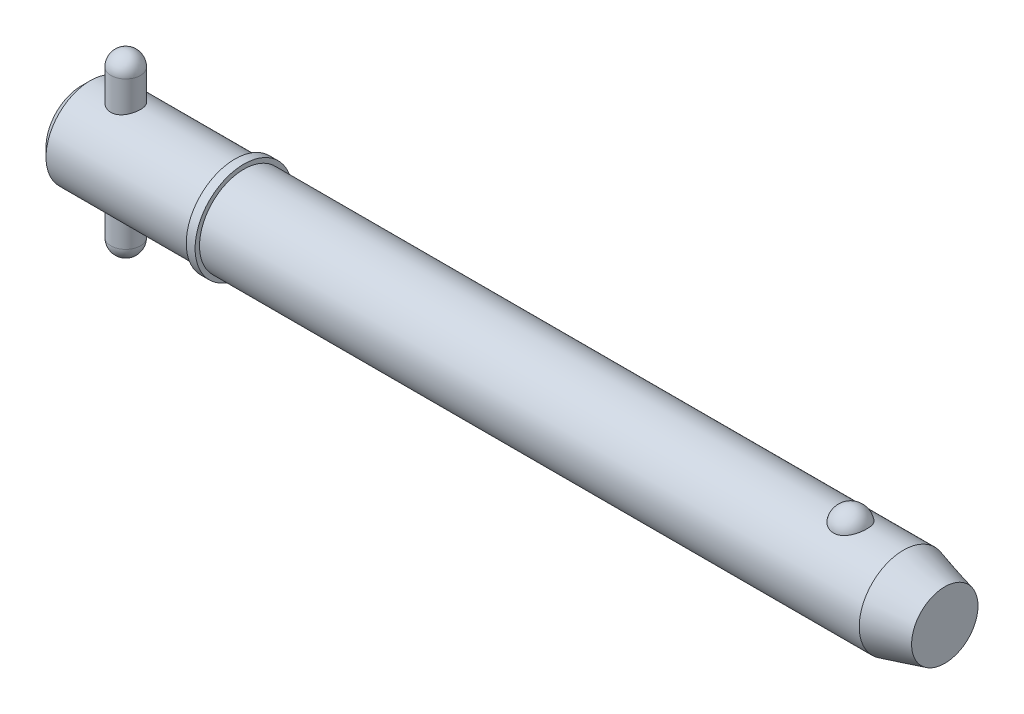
ISO-10303-21;
HEADER;
FILE_DESCRIPTION(('STEP AP214'),'2;1');
FILE_NAME('part.step','',(''),(''),'','','');
FILE_SCHEMA(('AUTOMOTIVE_DESIGN { 1 0 10303 214 1 1 1 1 }'));
ENDSEC;
DATA;
#1=APPLICATION_CONTEXT('core data for automotive mechanical design processes');
#2=APPLICATION_PROTOCOL_DEFINITION('international standard','automotive_design',2000,#1);
#3=PRODUCT_CONTEXT('',#1,'mechanical');
#4=PRODUCT('Part','Part','',(#3));
#5=PRODUCT_RELATED_PRODUCT_CATEGORY('part','',(#4));
#6=PRODUCT_DEFINITION_FORMATION('','',#4);
#7=PRODUCT_DEFINITION_CONTEXT('part definition',#1,'design');
#8=PRODUCT_DEFINITION('design','',#6,#7);
#9=PRODUCT_DEFINITION_SHAPE('','',#8);
#10=(LENGTH_UNIT() NAMED_UNIT(*) SI_UNIT(.MILLI.,.METRE.));
#11=(NAMED_UNIT(*) PLANE_ANGLE_UNIT() SI_UNIT($,.RADIAN.));
#12=(NAMED_UNIT(*) SI_UNIT($,.STERADIAN.) SOLID_ANGLE_UNIT());
#13=UNCERTAINTY_MEASURE_WITH_UNIT(LENGTH_MEASURE(1.E-05),#10,'distance_accuracy_value','');
#14=(GEOMETRIC_REPRESENTATION_CONTEXT(3) GLOBAL_UNCERTAINTY_ASSIGNED_CONTEXT((#13)) GLOBAL_UNIT_ASSIGNED_CONTEXT((#10,
#11,#12)) REPRESENTATION_CONTEXT('',''));
#15=CARTESIAN_POINT('',(0.,0.,0.));
#16=DIRECTION('',(0.,0.,1.));
#17=DIRECTION('',(1.,0.,0.));
#18=AXIS2_PLACEMENT_3D('',#15,#16,#17);
#19=CARTESIAN_POINT('',(9.525,19.05,0.));
#20=DIRECTION('',(0.,-1.,0.));
#21=DIRECTION('',(0.,0.,-1.));
#22=AXIS2_PLACEMENT_3D('',#19,#20,#21);
#23=CYLINDRICAL_SURFACE('',#22,3.175);
#24=CARTESIAN_POINT('',(9.525,-15.875,0.));
#25=DIRECTION('',(0.,-1.,0.));
#26=DIRECTION('',(0.,0.,-1.));
#27=AXIS2_PLACEMENT_3D('',#24,#25,#26);
#28=CIRCLE('',#27,3.175);
#29=CARTESIAN_POINT('',(9.525,-15.875,-3.175));
#30=VERTEX_POINT('',#29);
#31=EDGE_CURVE('P0_E10',#30,#30,#28,.F.);
#32=CARTESIAN_POINT('',(9.525,15.875,0.));
#33=DIRECTION('',(0.,-1.,0.));
#34=DIRECTION('',(0.,0.,-1.));
#35=AXIS2_PLACEMENT_3D('',#32,#33,#34);
#36=CIRCLE('',#35,3.175);
#37=CARTESIAN_POINT('',(9.525,15.875,-3.175));
#38=VERTEX_POINT('',#37);
#39=EDGE_CURVE('P0_E21',#38,#38,#36,.T.);
#40=CARTESIAN_POINT('',(9.525,-15.875,-3.175));
#41=CARTESIAN_POINT('',(9.525,-15.5442708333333,-3.175));
#42=CARTESIAN_POINT('',(9.525,-15.2135416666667,-3.175));
#43=CARTESIAN_POINT('',(9.525,-14.5520833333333,-3.175));
#44=CARTESIAN_POINT('',(9.525,-14.2213541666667,-3.175));
#45=CARTESIAN_POINT('',(9.525,-13.5598958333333,-3.175));
#46=CARTESIAN_POINT('',(9.525,-13.2291666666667,-3.175));
#47=CARTESIAN_POINT('',(9.525,-12.5677083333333,-3.175));
#48=CARTESIAN_POINT('',(9.525,-12.2369791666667,-3.175));
#49=CARTESIAN_POINT('',(9.525,-11.5755208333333,-3.175));
#50=CARTESIAN_POINT('',(9.525,-11.2447916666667,-3.175));
#51=CARTESIAN_POINT('',(9.525,-10.5833333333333,-3.175));
#52=CARTESIAN_POINT('',(9.525,-10.2526041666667,-3.175));
#53=CARTESIAN_POINT('',(9.525,-9.59114583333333,-3.175));
#54=CARTESIAN_POINT('',(9.525,-9.26041666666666,-3.175));
#55=CARTESIAN_POINT('',(9.525,-8.59895833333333,-3.175));
#56=CARTESIAN_POINT('',(9.525,-8.26822916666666,-3.175));
#57=CARTESIAN_POINT('',(9.525,-7.60677083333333,-3.175));
#58=CARTESIAN_POINT('',(9.525,-7.27604166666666,-3.175));
#59=CARTESIAN_POINT('',(9.525,-6.61458333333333,-3.175));
#60=CARTESIAN_POINT('',(9.525,-6.28385416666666,-3.175));
#61=CARTESIAN_POINT('',(9.525,-5.62239583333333,-3.175));
#62=CARTESIAN_POINT('',(9.525,-5.29166666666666,-3.175));
#63=CARTESIAN_POINT('',(9.525,-4.63020833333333,-3.175));
#64=CARTESIAN_POINT('',(9.525,-4.29947916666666,-3.175));
#65=CARTESIAN_POINT('',(9.525,-3.63802083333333,-3.175));
#66=CARTESIAN_POINT('',(9.525,-3.30729166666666,-3.175));
#67=CARTESIAN_POINT('',(9.525,-2.64583333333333,-3.175));
#68=CARTESIAN_POINT('',(9.525,-2.31510416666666,-3.175));
#69=CARTESIAN_POINT('',(9.525,-1.65364583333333,-3.175));
#70=CARTESIAN_POINT('',(9.525,-1.32291666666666,-3.175));
#71=CARTESIAN_POINT('',(9.525,-0.661458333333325,-3.175));
#72=CARTESIAN_POINT('',(9.525,-0.330729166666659,-3.175));
#73=CARTESIAN_POINT('',(9.525,0.330729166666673,-3.175));
#74=CARTESIAN_POINT('',(9.525,0.661458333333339,-3.175));
#75=CARTESIAN_POINT('',(9.525,1.32291666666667,-3.175));
#76=CARTESIAN_POINT('',(9.525,1.65364583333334,-3.175));
#77=CARTESIAN_POINT('',(9.525,2.31510416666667,-3.175));
#78=CARTESIAN_POINT('',(9.525,2.64583333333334,-3.175));
#79=CARTESIAN_POINT('',(9.525,3.30729166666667,-3.175));
#80=CARTESIAN_POINT('',(9.525,3.63802083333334,-3.175));
#81=CARTESIAN_POINT('',(9.525,4.29947916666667,-3.175));
#82=CARTESIAN_POINT('',(9.525,4.63020833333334,-3.175));
#83=CARTESIAN_POINT('',(9.525,5.29166666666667,-3.175));
#84=CARTESIAN_POINT('',(9.525,5.62239583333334,-3.175));
#85=CARTESIAN_POINT('',(9.525,6.28385416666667,-3.175));
#86=CARTESIAN_POINT('',(9.525,6.61458333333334,-3.175));
#87=CARTESIAN_POINT('',(9.525,7.27604166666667,-3.175));
#88=CARTESIAN_POINT('',(9.525,7.60677083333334,-3.175));
#89=CARTESIAN_POINT('',(9.525,8.26822916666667,-3.175));
#90=CARTESIAN_POINT('',(9.525,8.59895833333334,-3.175));
#91=CARTESIAN_POINT('',(9.525,9.26041666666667,-3.175));
#92=CARTESIAN_POINT('',(9.525,9.59114583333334,-3.175));
#93=CARTESIAN_POINT('',(9.525,10.2526041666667,-3.175));
#94=CARTESIAN_POINT('',(9.525,10.5833333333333,-3.175));
#95=CARTESIAN_POINT('',(9.525,11.2447916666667,-3.175));
#96=CARTESIAN_POINT('',(9.525,11.5755208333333,-3.175));
#97=CARTESIAN_POINT('',(9.525,12.2369791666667,-3.175));
#98=CARTESIAN_POINT('',(9.525,12.5677083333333,-3.175));
#99=CARTESIAN_POINT('',(9.525,13.2291666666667,-3.175));
#100=CARTESIAN_POINT('',(9.525,13.5598958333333,-3.175));
#101=CARTESIAN_POINT('',(9.525,14.2213541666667,-3.175));
#102=CARTESIAN_POINT('',(9.525,14.5520833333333,-3.175));
#103=CARTESIAN_POINT('',(9.525,15.2135416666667,-3.175));
#104=CARTESIAN_POINT('',(9.525,15.5442708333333,-3.175));
#105=CARTESIAN_POINT('',(9.525,15.875,-3.175));
#106=B_SPLINE_CURVE_WITH_KNOTS('',3,(#40,#41,#42,#43,#44,#45,#46,#47,#48,#49,#50,#51,#52,#53,
#54,#55,#56,#57,#58,#59,#60,#61,#62,#63,#64,#65,#66,#67,#68,#69,#70,#71,#72,#73,#74,#75,#76,#77,
#78,#79,#80,#81,#82,#83,#84,#85,#86,#87,#88,#89,#90,#91,#92,#93,#94,#95,#96,#97,#98,#99,#100,
#101,#102,#103,#104,#105),.UNSPECIFIED.,.F.,.F.,(4,2,2,2,2,2,2,2,2,2,2,2,2,2,2,2,2,2,2,2,2,2,2,
2,2,2,2,2,2,2,2,2,4),(0.,0.992187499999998,1.984375,2.9765625,3.96875,4.96093749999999,5.953125,
6.9453125,7.9375,8.92968749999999,9.921875,10.9140625,11.90625,12.8984375,13.890625,14.8828125,
15.875,16.8671875,17.859375,18.8515625,19.84375,20.8359375,21.828125,22.8203125,23.8125,
24.8046875,25.796875,26.7890625,27.78125,28.7734375,29.765625,30.7578125,31.75),.UNSPECIFIED.);
#107=EDGE_CURVE('P0_BSEAM14',#30,#38,#106,.T.);
#108=ORIENTED_EDGE('',*,*,#31,.T.);
#109=ORIENTED_EDGE('',*,*,#39,.T.);
#110=ORIENTED_EDGE('',*,*,#107,.T.);
#111=ORIENTED_EDGE('',*,*,#107,.F.);
#112=EDGE_LOOP('',(#108,#110,#109,#111));
#113=FACE_BOUND('',#112,.T.);
#114=ADVANCED_FACE('P0_F14',(#113),#23,.T.);
#115=CARTESIAN_POINT('',(9.525,-15.875,0.));
#116=DIRECTION('',(0.,0.,1.));
#117=DIRECTION('',(1.,0.,0.));
#118=AXIS2_PLACEMENT_3D('',#115,#116,#117);
#119=SPHERICAL_SURFACE('',#118,3.175);
#120=CARTESIAN_POINT('',(9.525,-15.875,0.));
#121=DIRECTION('',(0.,-1.,0.));
#122=DIRECTION('',(0.,0.,-1.));
#123=AXIS2_PLACEMENT_3D('',#120,#121,#122);
#124=SPHERICAL_SURFACE('',#123,3.175);
#125=ORIENTED_EDGE('',*,*,#31,.F.);
#126=EDGE_LOOP('',(#125));
#127=FACE_BOUND('',#126,.T.);
#128=ADVANCED_FACE('P0_F29',(#127),#124,.T.);
#129=CARTESIAN_POINT('',(9.525,15.875,0.));
#130=DIRECTION('',(0.,0.,1.));
#131=DIRECTION('',(1.,0.,0.));
#132=AXIS2_PLACEMENT_3D('',#129,#130,#131);
#133=SPHERICAL_SURFACE('',#132,3.175);
#134=CARTESIAN_POINT('',(9.525,15.875,0.));
#135=DIRECTION('',(0.,-1.,0.));
#136=DIRECTION('',(0.,0.,-1.));
#137=AXIS2_PLACEMENT_3D('',#134,#135,#136);
#138=SPHERICAL_SURFACE('',#137,3.175);
#139=ORIENTED_EDGE('',*,*,#39,.F.);
#140=EDGE_LOOP('',(#139));
#141=FACE_BOUND('',#140,.T.);
#142=ADVANCED_FACE('P0_F16',(#141),#138,.T.);
#143=CLOSED_SHELL('',(#114,#128,#142));
#144=MANIFOLD_SOLID_BREP('P0_B1',#143);
#145=CARTESIAN_POINT('',(0.,0.,0.));
#146=DIRECTION('',(1.,0.,0.));
#147=DIRECTION('',(0.,0.,-1.));
#148=AXIS2_PLACEMENT_3D('',#145,#146,#147);
#149=CYLINDRICAL_SURFACE('',#148,9.525);
#150=CARTESIAN_POINT('',(176.843054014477,0.,0.));
#151=DIRECTION('',(1.,0.,0.));
#152=DIRECTION('',(0.,0.,-1.));
#153=AXIS2_PLACEMENT_3D('',#150,#151,#152);
#154=CIRCLE('',#153,9.525);
#155=CARTESIAN_POINT('',(176.843054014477,0.,-9.525));
#156=VERTEX_POINT('',#155);
#157=EDGE_CURVE('P1_E81',#156,#156,#154,.T.);
#158=ORIENTED_EDGE('',*,*,#157,.F.);
#159=EDGE_LOOP('',(#158));
#160=FACE_BOUND('',#159,.T.);
#161=CARTESIAN_POINT('',(34.93,0.,0.));
#162=DIRECTION('',(1.,0.,0.));
#163=DIRECTION('',(0.,0.,-1.));
#164=AXIS2_PLACEMENT_3D('',#161,#162,#163);
#165=CIRCLE('',#164,9.525);
#166=CARTESIAN_POINT('',(34.93,0.,-9.525));
#167=VERTEX_POINT('',#166);
#168=EDGE_CURVE('P1_E85',#167,#167,#165,.T.);
#169=ORIENTED_EDGE('',*,*,#168,.T.);
#170=EDGE_LOOP('',(#169));
#171=FACE_BOUND('',#170,.T.);
#172=CARTESIAN_POINT('',(165.445757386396,8.80405803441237,3.63513233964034));
#173=CARTESIAN_POINT('',(165.351676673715,8.80405953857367,3.63513053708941));
#174=CARTESIAN_POINT('',(165.257561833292,8.80561325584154,3.63137461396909));
#175=CARTESIAN_POINT('',(165.070012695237,8.81177748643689,3.61638665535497));
#176=CARTESIAN_POINT('',(164.976578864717,8.81638992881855,3.60514990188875));
#177=CARTESIAN_POINT('',(164.697945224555,8.8346711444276,3.56024627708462));
#178=CARTESIAN_POINT('',(164.514691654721,8.85278327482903,3.51538626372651));
#179=CARTESIAN_POINT('',(164.159509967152,8.89871214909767,3.39742145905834));
#180=CARTESIAN_POINT('',(163.987553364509,8.92650327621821,3.32439116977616));
#181=CARTESIAN_POINT('',(163.658707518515,8.9887481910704,3.15220244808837));
#182=CARTESIAN_POINT('',(163.501811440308,9.02319893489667,3.05305594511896));
#183=CARTESIAN_POINT('',(163.202214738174,9.09629186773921,2.82797815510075));
#184=CARTESIAN_POINT('',(163.060060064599,9.13502685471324,2.70135138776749));
#185=CARTESIAN_POINT('',(162.798299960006,9.2118657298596,2.42641932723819));
#186=CARTESIAN_POINT('',(162.678701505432,9.24996941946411,2.27810735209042));
#187=CARTESIAN_POINT('',(162.459645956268,9.32341082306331,1.95652290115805));
#188=CARTESIAN_POINT('',(162.361317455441,9.35855090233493,1.78243511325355));
#189=CARTESIAN_POINT('',(162.193819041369,9.42045142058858,1.419372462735));
#190=CARTESIAN_POINT('',(162.124651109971,9.44721128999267,1.23039658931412));
#191=CARTESIAN_POINT('',(162.016199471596,9.48990641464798,0.840370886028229));
#192=CARTESIAN_POINT('',(161.977288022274,9.50570658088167,0.639202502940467));
#193=CARTESIAN_POINT('',(161.931555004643,9.52433146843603,0.232664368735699));
#194=CARTESIAN_POINT('',(161.924732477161,9.52715657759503,0.0272947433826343));
#195=CARTESIAN_POINT('',(161.943255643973,9.51956918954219,-0.380478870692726));
#196=CARTESIAN_POINT('',(161.968405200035,9.50923740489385,-0.582893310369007));
#197=CARTESIAN_POINT('',(162.05002537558,9.47651897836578,-0.980293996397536));
#198=CARTESIAN_POINT('',(162.106496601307,9.45413210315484,-1.17528009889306));
#199=CARTESIAN_POINT('',(162.249719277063,9.39954044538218,-1.55263697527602));
#200=CARTESIAN_POINT('',(162.336512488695,9.36732213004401,-1.73498993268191));
#201=CARTESIAN_POINT('',(162.538610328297,9.29640700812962,-2.08177763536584));
#202=CARTESIAN_POINT('',(162.653917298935,9.25770966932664,-2.24621090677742));
#203=CARTESIAN_POINT('',(162.911264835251,9.17775604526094,-2.5533833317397));
#204=CARTESIAN_POINT('',(163.053434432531,9.136488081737,-2.696011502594));
#205=CARTESIAN_POINT('',(163.36089985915,9.05620497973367,-2.95451229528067));
#206=CARTESIAN_POINT('',(163.526193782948,9.01718965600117,-3.07038711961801));
#207=CARTESIAN_POINT('',(163.872052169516,8.94680019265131,-3.26976836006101));
#208=CARTESIAN_POINT('',(164.052227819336,8.91528408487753,-3.35389750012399));
#209=CARTESIAN_POINT('',(164.425651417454,8.86272514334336,-3.49043503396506));
#210=CARTESIAN_POINT('',(164.618894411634,8.84167836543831,-3.54285537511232));
#211=CARTESIAN_POINT('',(165.002503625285,8.81348056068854,-3.61241306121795));
#212=CARTESIAN_POINT('',(165.192525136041,8.80568348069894,-3.6311933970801));
#213=CARTESIAN_POINT('',(165.573190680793,8.80289410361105,-3.63795342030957));
#214=CARTESIAN_POINT('',(165.763834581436,8.80789922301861,-3.62593932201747));
#215=CARTESIAN_POINT('',(166.134007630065,8.82974915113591,-3.57238430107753));
#216=CARTESIAN_POINT('',(166.313697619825,8.84621463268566,-3.53178890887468));
#217=CARTESIAN_POINT('',(166.663422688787,8.88875330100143,-3.42331083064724));
#218=CARTESIAN_POINT('',(166.833456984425,8.91482726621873,-3.35542593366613));
#219=CARTESIAN_POINT('',(167.163237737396,8.97448239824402,-3.19248225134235));
#220=CARTESIAN_POINT('',(167.322680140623,9.00821446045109,-3.0968647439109));
#221=CARTESIAN_POINT('',(167.623513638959,9.07935398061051,-2.88162736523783));
#222=CARTESIAN_POINT('',(167.764900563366,9.11676228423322,-2.76200196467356));
#223=CARTESIAN_POINT('',(168.03331931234,9.19347419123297,-2.49516285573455));
#224=CARTESIAN_POINT('',(168.159275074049,9.23277872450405,-2.34686614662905));
#225=CARTESIAN_POINT('',(168.385522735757,9.30737610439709,-2.03093683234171));
#226=CARTESIAN_POINT('',(168.48581004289,9.34266823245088,-1.86330077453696));
#227=CARTESIAN_POINT('',(168.661514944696,9.40674710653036,-1.50744893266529));
#228=CARTESIAN_POINT('',(168.736041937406,9.4352917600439,-1.31874876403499));
#229=CARTESIAN_POINT('',(168.85416505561,9.48144132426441,-0.930631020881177));
#230=CARTESIAN_POINT('',(168.897760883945,9.49904612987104,-0.731213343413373));
#231=CARTESIAN_POINT('',(168.953158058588,9.5215314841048,-0.327147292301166));
#232=CARTESIAN_POINT('',(168.964935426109,9.52640243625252,-0.122495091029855));
#233=CARTESIAN_POINT('',(168.956382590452,9.52289571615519,0.286018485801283));
#234=CARTESIAN_POINT('',(168.93605305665,9.51451832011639,0.489879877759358));
#235=CARTESIAN_POINT('',(168.863884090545,9.48544083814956,0.889994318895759));
#236=CARTESIAN_POINT('',(168.812199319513,9.46480124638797,1.08627971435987));
#237=CARTESIAN_POINT('',(168.678491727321,9.41333895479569,1.46682086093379));
#238=CARTESIAN_POINT('',(168.596466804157,9.38251554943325,1.65107577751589));
#239=CARTESIAN_POINT('',(168.40319292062,9.31365636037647,2.00346348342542));
#240=CARTESIAN_POINT('',(168.291783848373,9.27558138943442,2.17150083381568));
#241=CARTESIAN_POINT('',(168.042294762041,9.19638714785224,2.48563115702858));
#242=CARTESIAN_POINT('',(167.904216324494,9.15526805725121,2.63172542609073));
#243=CARTESIAN_POINT('',(167.604843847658,9.07465393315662,2.89750997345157));
#244=CARTESIAN_POINT('',(167.443610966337,9.03515496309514,3.01726776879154));
#245=CARTESIAN_POINT('',(167.101613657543,8.96227564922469,3.22732920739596));
#246=CARTESIAN_POINT('',(166.920841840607,8.92889763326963,3.31762165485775));
#247=CARTESIAN_POINT('',(166.551445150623,8.8734538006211,3.46314419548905));
#248=CARTESIAN_POINT('',(166.36332371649,8.85102983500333,3.51950082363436));
#249=CARTESIAN_POINT('',(166.07578699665,8.8266696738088,3.57993683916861));
#250=CARTESIAN_POINT('',(165.979133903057,8.82009725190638,3.5960621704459));
#251=CARTESIAN_POINT('',(165.784677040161,8.81020897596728,3.62022512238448));
#252=CARTESIAN_POINT('',(165.68687410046,8.80689090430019,3.62826825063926));
#253=CARTESIAN_POINT('',(165.541224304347,8.80445615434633,3.63416760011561));
#254=CARTESIAN_POINT('',(165.493495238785,8.80405727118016,3.63513325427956));
#255=CARTESIAN_POINT('',(165.445757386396,8.80405803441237,3.63513233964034));
#256=B_SPLINE_CURVE_WITH_KNOTS('',3,(#172,#173,#174,#175,#176,#177,#178,#179,#180,#181,#182,
#183,#184,#185,#186,#187,#188,#189,#190,#191,#192,#193,#194,#195,#196,#197,#198,#199,#200,#201,
#202,#203,#204,#205,#206,#207,#208,#209,#210,#211,#212,#213,#214,#215,#216,#217,#218,#219,#220,
#221,#222,#223,#224,#225,#226,#227,#228,#229,#230,#231,#232,#233,#234,#235,#236,#237,#238,#239,
#240,#241,#242,#243,#244,#245,#246,#247,#248,#249,#250,#251,#252,#253,#254,#255),.UNSPECIFIED.,
.T.,.F.,(4,2,2,2,2,2,2,2,2,2,2,2,2,2,2,2,2,2,2,2,2,2,2,2,2,2,2,2,2,2,2,2,2,2,2,2,2,2,2,2,2,4),
(0.,0.282202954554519,0.564584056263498,1.13017050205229,1.69427128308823,2.25811483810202,
2.83836627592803,3.41879688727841,4.02497117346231,4.63118665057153,5.2447475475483,
5.85829010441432,6.46808687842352,7.07789545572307,7.68854723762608,8.29924920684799,
8.9129628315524,9.52662591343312,10.1275338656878,10.7282152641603,11.2986646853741,
11.8689989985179,12.4213015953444,12.973648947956,13.5380053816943,14.1024919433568,
14.695298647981,15.2882113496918,15.8999469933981,16.5116885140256,17.1238909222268,
17.7360805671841,18.3452748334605,18.9545113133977,19.567138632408,20.179729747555,
20.7907316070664,21.4019653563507,21.9915938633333,22.2859053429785,22.5800161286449,
22.7232098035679),.UNSPECIFIED.);
#257=CARTESIAN_POINT('',(165.445757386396,8.80405803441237,3.63513233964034));
#258=VERTEX_POINT('',#257);
#259=EDGE_CURVE('P1_E35',#258,#258,#256,.T.);
#260=ORIENTED_EDGE('',*,*,#259,.T.);
#261=EDGE_LOOP('',(#260));
#262=FACE_BOUND('',#261,.T.);
#263=ADVANCED_FACE('P1_F13',(#160,#171,#262),#149,.T.);
#264=CARTESIAN_POINT('',(0.,0.,0.));
#265=DIRECTION('',(-1.,0.,0.));
#266=DIRECTION('',(0.,0.,1.));
#267=AXIS2_PLACEMENT_3D('',#264,#265,#266);
#268=PLANE('',#267);
#269=CARTESIAN_POINT('',(0.,0.,0.));
#270=DIRECTION('',(1.,0.,0.));
#271=DIRECTION('',(0.,0.,-1.));
#272=AXIS2_PLACEMENT_3D('',#269,#270,#271);
#273=CIRCLE('',#272,7.62);
#274=CARTESIAN_POINT('',(0.,0.,-7.62));
#275=VERTEX_POINT('',#274);
#276=EDGE_CURVE('P1_E9',#275,#275,#273,.T.);
#277=ORIENTED_EDGE('',*,*,#276,.F.);
#278=EDGE_LOOP('',(#277));
#279=FACE_BOUND('',#278,.T.);
#280=ADVANCED_FACE('P1_F15',(#279),#268,.T.);
#281=CARTESIAN_POINT('',(1.90499999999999,0.,0.));
#282=DIRECTION('',(1.,0.,0.));
#283=DIRECTION('',(0.,0.,-1.));
#284=AXIS2_PLACEMENT_3D('',#281,#282,#283);
#285=CONICAL_SURFACE('',#284,9.525,0.785398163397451);
#286=ORIENTED_EDGE('',*,*,#276,.T.);
#287=EDGE_LOOP('',(#286));
#288=FACE_BOUND('',#287,.T.);
#289=CARTESIAN_POINT('',(1.90499999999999,0.,0.));
#290=DIRECTION('',(1.,0.,0.));
#291=DIRECTION('',(0.,0.,-1.));
#292=AXIS2_PLACEMENT_3D('',#289,#290,#291);
#293=CIRCLE('',#292,9.525);
#294=CARTESIAN_POINT('',(1.90499999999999,0.,-9.525));
#295=VERTEX_POINT('',#294);
#296=EDGE_CURVE('P1_E26',#295,#295,#293,.T.);
#297=ORIENTED_EDGE('',*,*,#296,.F.);
#298=EDGE_LOOP('',(#297));
#299=FACE_BOUND('',#298,.T.);
#300=ADVANCED_FACE('P1_F77',(#288,#299),#285,.T.);
#301=CARTESIAN_POINT('',(0.,0.,0.));
#302=DIRECTION('',(1.,0.,0.));
#303=DIRECTION('',(0.,0.,-1.));
#304=AXIS2_PLACEMENT_3D('',#301,#302,#303);
#305=CYLINDRICAL_SURFACE('',#304,9.525);
#306=CARTESIAN_POINT('',(9.525,-8.98025612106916,3.175));
#307=CARTESIAN_POINT('',(9.35206354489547,-8.98025555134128,3.17500081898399));
#308=CARTESIAN_POINT('',(9.17913201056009,-8.98530617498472,3.16082293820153));
#309=CARTESIAN_POINT('',(8.83839221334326,-9.00485797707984,3.10467734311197));
#310=CARTESIAN_POINT('',(8.67058479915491,-9.0193607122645,3.06270505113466));
#311=CARTESIAN_POINT('',(8.34508461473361,-9.05599546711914,2.95260866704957));
#312=CARTESIAN_POINT('',(8.18737272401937,-9.07811252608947,2.88453582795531));
#313=CARTESIAN_POINT('',(7.88555684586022,-9.12746212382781,2.72434567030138));
#314=CARTESIAN_POINT('',(7.74145587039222,-9.1546957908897,2.63222304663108));
#315=CARTESIAN_POINT('',(7.46531411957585,-9.21240503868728,2.42268738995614));
#316=CARTESIAN_POINT('',(7.33388351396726,-9.24296141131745,2.30449228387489));
#317=CARTESIAN_POINT('',(7.09229340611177,-9.30319020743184,2.0478358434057));
#318=CARTESIAN_POINT('',(6.98213731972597,-9.33286248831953,1.90937126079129));
#319=CARTESIAN_POINT('',(6.78345450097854,-9.38891527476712,1.61164431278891));
#320=CARTESIAN_POINT('',(6.69556709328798,-9.41518969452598,1.45193356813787));
#321=CARTESIAN_POINT('',(6.54814671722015,-9.46053437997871,1.11896913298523));
#322=CARTESIAN_POINT('',(6.48860610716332,-9.47960658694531,0.945719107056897));
#323=CARTESIAN_POINT('',(6.40163866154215,-9.50782564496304,0.596991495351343));
#324=CARTESIAN_POINT('',(6.373166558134,-9.5172947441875,0.421801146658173));
#325=CARTESIAN_POINT('',(6.3458207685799,-9.52638456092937,0.068890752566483));
#326=CARTESIAN_POINT('',(6.34693945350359,-9.52600781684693,-0.108828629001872));
#327=CARTESIAN_POINT('',(6.37808050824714,-9.51566675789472,-0.454353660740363));
#328=CARTESIAN_POINT('',(6.4069675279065,-9.50607905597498,-0.622274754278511));
#329=CARTESIAN_POINT('',(6.490947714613,-9.47886621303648,-0.950732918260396));
#330=CARTESIAN_POINT('',(6.54604265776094,-9.46124052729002,-1.11126948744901));
#331=CARTESIAN_POINT('',(6.68153768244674,-9.41945253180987,-1.42288410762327));
#332=CARTESIAN_POINT('',(6.76226085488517,-9.3952073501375,-1.57381010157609));
#333=CARTESIAN_POINT('',(6.94645456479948,-9.34270397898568,-1.86030973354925));
#334=CARTESIAN_POINT('',(7.04993142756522,-9.31444467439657,-1.99587908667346));
#335=CARTESIAN_POINT('',(7.28241619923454,-9.25532159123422,-2.2545702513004));
#336=CARTESIAN_POINT('',(7.4123967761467,-9.22439783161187,-2.37680549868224));
#337=CARTESIAN_POINT('',(7.69127470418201,-9.1645528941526,-2.5980302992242));
#338=CARTESIAN_POINT('',(7.84017496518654,-9.13563202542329,-2.6970162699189));
#339=CARTESIAN_POINT('',(8.15547526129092,-9.08273917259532,-2.87016016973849));
#340=CARTESIAN_POINT('',(8.32209451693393,-9.05884361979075,-2.94394402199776));
#341=CARTESIAN_POINT('',(8.66638917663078,-9.01959241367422,-3.06210713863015));
#342=CARTESIAN_POINT('',(8.84405991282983,-9.00423318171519,-3.10649872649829));
#343=CARTESIAN_POINT('',(9.19682677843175,-8.98460345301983,-3.16281207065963));
#344=CARTESIAN_POINT('',(9.37167742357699,-8.9798639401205,-3.17610837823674));
#345=CARTESIAN_POINT('',(9.72113927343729,-8.9806993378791,-3.17374726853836));
#346=CARTESIAN_POINT('',(9.89575051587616,-8.98627237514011,-3.15809511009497));
#347=CARTESIAN_POINT('',(10.2335233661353,-9.00663737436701,-3.09951644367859));
#348=CARTESIAN_POINT('',(10.3968722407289,-9.02110608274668,-3.05754530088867));
#349=CARTESIAN_POINT('',(10.7141759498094,-9.05727657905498,-2.94866651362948));
#350=CARTESIAN_POINT('',(10.8681291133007,-9.07897964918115,-2.88175444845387));
#351=CARTESIAN_POINT('',(11.1676828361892,-9.12802586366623,-2.72248103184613));
#352=CARTESIAN_POINT('',(11.3128635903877,-9.1555260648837,-2.62937980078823));
#353=CARTESIAN_POINT('',(11.5860387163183,-9.21276315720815,-2.42120937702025));
#354=CARTESIAN_POINT('',(11.7140280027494,-9.24250070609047,-2.30613370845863));
#355=CARTESIAN_POINT('',(11.9555513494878,-9.30259247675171,-2.05070616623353));
#356=CARTESIAN_POINT('',(12.0680936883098,-9.33290753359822,-1.90940458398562));
#357=CARTESIAN_POINT('',(12.267933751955,-9.3893275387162,-1.60917665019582));
#358=CARTESIAN_POINT('',(12.3552323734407,-9.41543263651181,-1.45025092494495));
#359=CARTESIAN_POINT('',(12.5013088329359,-9.46036988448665,-1.12007606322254));
#360=CARTESIAN_POINT('',(12.5602723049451,-9.47924920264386,-0.9489158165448));
#361=CARTESIAN_POINT('',(12.6483355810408,-9.50781089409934,-0.598355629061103));
#362=CARTESIAN_POINT('',(12.6774461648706,-9.5174965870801,-0.4189586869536));
#363=CARTESIAN_POINT('',(12.7040070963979,-9.52632915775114,-0.066088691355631));
#364=CARTESIAN_POINT('',(12.7028811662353,-9.52594996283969,0.107266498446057));
#365=CARTESIAN_POINT('',(12.6725130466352,-9.51586223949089,0.451202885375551));
#366=CARTESIAN_POINT('',(12.643273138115,-9.50615446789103,0.621784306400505));
#367=CARTESIAN_POINT('',(12.5584514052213,-9.47867404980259,0.952633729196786));
#368=CARTESIAN_POINT('',(12.5032953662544,-9.46103195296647,1.1130225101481));
#369=CARTESIAN_POINT('',(12.3686013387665,-9.41949985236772,1.42233126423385));
#370=CARTESIAN_POINT('',(12.2890589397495,-9.39560871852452,1.57124915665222));
#371=CARTESIAN_POINT('',(12.1044667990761,-9.34294133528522,1.85938800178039));
#372=CARTESIAN_POINT('',(11.9985831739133,-9.31401720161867,1.9980473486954));
#373=CARTESIAN_POINT('',(11.7657327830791,-9.25490239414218,2.25609475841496));
#374=CARTESIAN_POINT('',(11.6387592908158,-9.22471131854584,2.37547664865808));
#375=CARTESIAN_POINT('',(11.3613902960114,-9.16505913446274,2.59633024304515));
#376=CARTESIAN_POINT('',(11.2102725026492,-9.13567286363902,2.69691791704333));
#377=CARTESIAN_POINT('',(10.8923631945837,-9.08241113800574,2.87119803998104));
#378=CARTESIAN_POINT('',(10.7255757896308,-9.05853424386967,2.94489751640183));
#379=CARTESIAN_POINT('',(10.3887212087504,-9.02021736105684,3.06020415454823));
#380=CARTESIAN_POINT('',(10.219143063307,-9.00539959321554,3.10311136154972));
#381=CARTESIAN_POINT('',(9.87470703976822,-8.98542092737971,3.16050396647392));
#382=CARTESIAN_POINT('',(9.699851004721,-8.98025669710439,3.17499917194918));
#383=CARTESIAN_POINT('',(9.525,-8.98025612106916,3.175));
#384=B_SPLINE_CURVE_WITH_KNOTS('',3,(#306,#307,#308,#309,#310,#311,#312,#313,#314,#315,#316,
#317,#318,#319,#320,#321,#322,#323,#324,#325,#326,#327,#328,#329,#330,#331,#332,#333,#334,#335,
#336,#337,#338,#339,#340,#341,#342,#343,#344,#345,#346,#347,#348,#349,#350,#351,#352,#353,#354,
#355,#356,#357,#358,#359,#360,#361,#362,#363,#364,#365,#366,#367,#368,#369,#370,#371,#372,#373,
#374,#375,#376,#377,#378,#379,#380,#381,#382,#383),.UNSPECIFIED.,.T.,.F.,(4,2,2,2,2,2,2,2,2,2,2,
2,2,2,2,2,2,2,2,2,2,2,2,2,2,2,2,2,2,2,2,2,2,2,2,2,2,2,4),(0.,0.518161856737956,1.03640907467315,
1.55364379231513,2.07099270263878,2.60671746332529,3.14252816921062,3.69231882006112,
4.24196117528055,4.77247962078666,5.30286129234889,5.81244090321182,6.32205505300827,
6.83836754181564,7.3548237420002,7.89559553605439,8.43645060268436,8.98501631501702,
9.53335188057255,10.056948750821,10.5804505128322,11.0859695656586,11.5915782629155,
12.1132237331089,12.6350231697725,13.1819271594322,13.7288117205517,14.2720628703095,
14.815117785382,15.3326491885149,15.8501386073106,16.3594083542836,16.868770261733,
17.3969527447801,17.925304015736,18.4743376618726,19.023227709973,19.5473069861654,
20.0712053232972),.UNSPECIFIED.);
#385=CARTESIAN_POINT('',(9.525,-8.98025612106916,3.175));
#386=VERTEX_POINT('',#385);
#387=EDGE_CURVE('P1_E17',#386,#386,#384,.T.);
#388=ORIENTED_EDGE('',*,*,#387,.F.);
#389=EDGE_LOOP('',(#388));
#390=FACE_BOUND('',#389,.T.);
#391=CARTESIAN_POINT('',(9.525,8.98025612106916,3.175));
#392=CARTESIAN_POINT('',(9.69793645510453,8.98025555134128,3.17500081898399));
#393=CARTESIAN_POINT('',(9.87086798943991,8.98530617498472,3.16082293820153));
#394=CARTESIAN_POINT('',(10.2116077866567,9.00485797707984,3.10467734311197));
#395=CARTESIAN_POINT('',(10.3794152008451,9.0193607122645,3.06270505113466));
#396=CARTESIAN_POINT('',(10.7049153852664,9.05599546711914,2.95260866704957));
#397=CARTESIAN_POINT('',(10.8626272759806,9.07811252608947,2.88453582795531));
#398=CARTESIAN_POINT('',(11.1644431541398,9.12746212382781,2.72434567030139));
#399=CARTESIAN_POINT('',(11.3085441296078,9.15469579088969,2.63222304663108));
#400=CARTESIAN_POINT('',(11.5846858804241,9.21240503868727,2.42268738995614));
#401=CARTESIAN_POINT('',(11.7161164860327,9.24296141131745,2.30449228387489));
#402=CARTESIAN_POINT('',(11.9577065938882,9.30319020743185,2.0478358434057));
#403=CARTESIAN_POINT('',(12.067862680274,9.33286248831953,1.90937126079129));
#404=CARTESIAN_POINT('',(12.2665454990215,9.38891527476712,1.61164431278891));
#405=CARTESIAN_POINT('',(12.354432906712,9.41518969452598,1.45193356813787));
#406=CARTESIAN_POINT('',(12.5018532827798,9.46053437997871,1.11896913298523));
#407=CARTESIAN_POINT('',(12.5613938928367,9.47960658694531,0.945719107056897));
#408=CARTESIAN_POINT('',(12.6483613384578,9.50782564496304,0.596991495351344));
#409=CARTESIAN_POINT('',(12.676833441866,9.5172947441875,0.421801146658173));
#410=CARTESIAN_POINT('',(12.7041792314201,9.52638456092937,0.0688907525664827));
#411=CARTESIAN_POINT('',(12.7030605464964,9.52600781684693,-0.108828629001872));
#412=CARTESIAN_POINT('',(12.6719194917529,9.51566675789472,-0.454353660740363));
#413=CARTESIAN_POINT('',(12.6430324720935,9.50607905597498,-0.622274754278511));
#414=CARTESIAN_POINT('',(12.559052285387,9.47886621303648,-0.950732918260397));
#415=CARTESIAN_POINT('',(12.5039573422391,9.46124052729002,-1.11126948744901));
#416=CARTESIAN_POINT('',(12.3684623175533,9.41945253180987,-1.42288410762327));
#417=CARTESIAN_POINT('',(12.2877391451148,9.3952073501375,-1.57381010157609));
#418=CARTESIAN_POINT('',(12.1035454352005,9.34270397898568,-1.86030973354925));
#419=CARTESIAN_POINT('',(12.0000685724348,9.31444467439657,-1.99587908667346));
#420=CARTESIAN_POINT('',(11.7675838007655,9.25532159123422,-2.2545702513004));
#421=CARTESIAN_POINT('',(11.6376032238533,9.22439783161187,-2.37680549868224));
#422=CARTESIAN_POINT('',(11.358725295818,9.1645528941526,-2.5980302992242));
#423=CARTESIAN_POINT('',(11.2098250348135,9.13563202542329,-2.6970162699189));
#424=CARTESIAN_POINT('',(10.8945247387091,9.08273917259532,-2.87016016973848));
#425=CARTESIAN_POINT('',(10.7279054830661,9.05884361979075,-2.94394402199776));
#426=CARTESIAN_POINT('',(10.3836108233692,9.01959241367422,-3.06210713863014));
#427=CARTESIAN_POINT('',(10.2059400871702,9.00423318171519,-3.10649872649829));
#428=CARTESIAN_POINT('',(9.85317322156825,8.98460345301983,-3.16281207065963));
#429=CARTESIAN_POINT('',(9.67832257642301,8.9798639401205,-3.17610837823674));
#430=CARTESIAN_POINT('',(9.32886072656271,8.9806993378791,-3.17374726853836));
#431=CARTESIAN_POINT('',(9.15424948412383,8.98627237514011,-3.15809511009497));
#432=CARTESIAN_POINT('',(8.81647663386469,9.00663737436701,-3.09951644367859));
#433=CARTESIAN_POINT('',(8.65312775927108,9.02110608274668,-3.05754530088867));
#434=CARTESIAN_POINT('',(8.33582405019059,9.05727657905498,-2.94866651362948));
#435=CARTESIAN_POINT('',(8.18187088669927,9.07897964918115,-2.88175444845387));
#436=CARTESIAN_POINT('',(7.88231716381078,9.12802586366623,-2.72248103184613));
#437=CARTESIAN_POINT('',(7.73713640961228,9.1555260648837,-2.62937980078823));
#438=CARTESIAN_POINT('',(7.46396128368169,9.21276315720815,-2.42120937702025));
#439=CARTESIAN_POINT('',(7.33597199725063,9.24250070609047,-2.30613370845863));
#440=CARTESIAN_POINT('',(7.09444865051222,9.30259247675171,-2.05070616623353));
#441=CARTESIAN_POINT('',(6.98190631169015,9.33290753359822,-1.90940458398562));
#442=CARTESIAN_POINT('',(6.78206624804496,9.3893275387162,-1.60917665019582));
#443=CARTESIAN_POINT('',(6.6947676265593,9.41543263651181,-1.45025092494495));
#444=CARTESIAN_POINT('',(6.54869116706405,9.46036988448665,-1.12007606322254));
#445=CARTESIAN_POINT('',(6.48972769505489,9.47924920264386,-0.948915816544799));
#446=CARTESIAN_POINT('',(6.40166441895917,9.50781089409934,-0.598355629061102));
#447=CARTESIAN_POINT('',(6.3725538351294,9.5174965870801,-0.418958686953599));
#448=CARTESIAN_POINT('',(6.34599290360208,9.52632915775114,-0.0660886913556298));
#449=CARTESIAN_POINT('',(6.3471188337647,9.52594996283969,0.107266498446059));
#450=CARTESIAN_POINT('',(6.37748695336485,9.51586223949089,0.451202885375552));
#451=CARTESIAN_POINT('',(6.40672686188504,9.50615446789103,0.621784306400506));
#452=CARTESIAN_POINT('',(6.49154859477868,9.47867404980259,0.952633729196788));
#453=CARTESIAN_POINT('',(6.54670463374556,9.46103195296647,1.11302251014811));
#454=CARTESIAN_POINT('',(6.68139866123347,9.41949985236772,1.42233126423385));
#455=CARTESIAN_POINT('',(6.76094106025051,9.39560871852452,1.57124915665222));
#456=CARTESIAN_POINT('',(6.94553320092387,9.34294133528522,1.85938800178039));
#457=CARTESIAN_POINT('',(7.05141682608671,9.31401720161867,1.9980473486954));
#458=CARTESIAN_POINT('',(7.28426721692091,9.25490239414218,2.25609475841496));
#459=CARTESIAN_POINT('',(7.41124070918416,9.22471131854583,2.37547664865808));
#460=CARTESIAN_POINT('',(7.68860970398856,9.16505913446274,2.59633024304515));
#461=CARTESIAN_POINT('',(7.83972749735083,9.13567286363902,2.69691791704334));
#462=CARTESIAN_POINT('',(8.15763680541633,9.08241113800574,2.87119803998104));
#463=CARTESIAN_POINT('',(8.32442421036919,9.05853424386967,2.94489751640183));
#464=CARTESIAN_POINT('',(8.66127879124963,9.02021736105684,3.06020415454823));
#465=CARTESIAN_POINT('',(8.83085693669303,9.00539959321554,3.10311136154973));
#466=CARTESIAN_POINT('',(9.17529296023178,8.98542092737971,3.16050396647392));
#467=CARTESIAN_POINT('',(9.350148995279,8.98025669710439,3.17499917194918));
#468=CARTESIAN_POINT('',(9.525,8.98025612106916,3.175));
#469=B_SPLINE_CURVE_WITH_KNOTS('',3,(#391,#392,#393,#394,#395,#396,#397,#398,#399,#400,#401,
#402,#403,#404,#405,#406,#407,#408,#409,#410,#411,#412,#413,#414,#415,#416,#417,#418,#419,#420,
#421,#422,#423,#424,#425,#426,#427,#428,#429,#430,#431,#432,#433,#434,#435,#436,#437,#438,#439,
#440,#441,#442,#443,#444,#445,#446,#447,#448,#449,#450,#451,#452,#453,#454,#455,#456,#457,#458,
#459,#460,#461,#462,#463,#464,#465,#466,#467,#468),.UNSPECIFIED.,.T.,.F.,(4,2,2,2,2,2,2,2,2,2,2,
2,2,2,2,2,2,2,2,2,2,2,2,2,2,2,2,2,2,2,2,2,2,2,2,2,2,2,4),(0.,0.518161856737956,1.03640907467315,
1.55364379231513,2.07099270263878,2.60671746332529,3.14252816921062,3.69231882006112,
4.24196117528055,4.77247962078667,5.30286129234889,5.81244090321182,6.32205505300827,
6.83836754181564,7.3548237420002,7.89559553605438,8.43645060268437,8.98501631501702,
9.53335188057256,10.056948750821,10.5804505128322,11.0859695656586,11.5915782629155,
12.1132237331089,12.6350231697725,13.1819271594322,13.7288117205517,14.2720628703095,
14.815117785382,15.3326491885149,15.8501386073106,16.3594083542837,16.868770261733,
17.3969527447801,17.9253040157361,18.4743376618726,19.023227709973,19.5473069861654,
20.0712053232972),.UNSPECIFIED.);
#470=CARTESIAN_POINT('',(9.525,8.98025612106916,3.175));
#471=VERTEX_POINT('',#470);
#472=EDGE_CURVE('P1_E43',#471,#471,#469,.T.);
#473=ORIENTED_EDGE('',*,*,#472,.F.);
#474=EDGE_LOOP('',(#473));
#475=FACE_BOUND('',#474,.T.);
#476=ORIENTED_EDGE('',*,*,#296,.T.);
#477=EDGE_LOOP('',(#476));
#478=FACE_BOUND('',#477,.T.);
#479=CARTESIAN_POINT('',(33.025,0.,0.));
#480=DIRECTION('',(1.,0.,0.));
#481=DIRECTION('',(0.,0.,-1.));
#482=AXIS2_PLACEMENT_3D('',#479,#480,#481);
#483=CIRCLE('',#482,9.525);
#484=CARTESIAN_POINT('',(33.025,0.,-9.525));
#485=VERTEX_POINT('',#484);
#486=EDGE_CURVE('P1_E31',#485,#485,#483,.T.);
#487=ORIENTED_EDGE('',*,*,#486,.F.);
#488=EDGE_LOOP('',(#487));
#489=FACE_BOUND('',#488,.T.);
#490=ADVANCED_FACE('P1_F103',(#390,#475,#478,#489),#305,.T.);
#491=CARTESIAN_POINT('',(33.025,9.525,0.));
#492=DIRECTION('',(-1.,0.,0.));
#493=DIRECTION('',(0.,0.,1.));
#494=AXIS2_PLACEMENT_3D('',#491,#492,#493);
#495=PLANE('',#494);
#496=ORIENTED_EDGE('',*,*,#486,.T.);
#497=EDGE_LOOP('',(#496));
#498=FACE_BOUND('',#497,.T.);
#499=CARTESIAN_POINT('',(33.025,0.,0.));
#500=DIRECTION('',(1.,0.,0.));
#501=DIRECTION('',(0.,0.,-1.));
#502=AXIS2_PLACEMENT_3D('',#499,#500,#501);
#503=CIRCLE('',#502,10.4775);
#504=CARTESIAN_POINT('',(33.025,0.,-10.4775));
#505=VERTEX_POINT('',#504);
#506=EDGE_CURVE('P1_E91',#505,#505,#503,.T.);
#507=ORIENTED_EDGE('',*,*,#506,.F.);
#508=EDGE_LOOP('',(#507));
#509=FACE_BOUND('',#508,.T.);
#510=ADVANCED_FACE('P1_F100',(#498,#509),#495,.T.);
#511=CARTESIAN_POINT('',(0.,0.,0.));
#512=DIRECTION('',(1.,0.,0.));
#513=DIRECTION('',(0.,0.,-1.));
#514=AXIS2_PLACEMENT_3D('',#511,#512,#513);
#515=CYLINDRICAL_SURFACE('',#514,10.4775);
#516=ORIENTED_EDGE('',*,*,#506,.T.);
#517=EDGE_LOOP('',(#516));
#518=FACE_BOUND('',#517,.T.);
#519=CARTESIAN_POINT('',(34.93,0.,0.));
#520=DIRECTION('',(1.,0.,0.));
#521=DIRECTION('',(0.,0.,-1.));
#522=AXIS2_PLACEMENT_3D('',#519,#520,#521);
#523=CIRCLE('',#522,10.4775);
#524=CARTESIAN_POINT('',(34.93,0.,-10.4775));
#525=VERTEX_POINT('',#524);
#526=EDGE_CURVE('P1_E88',#525,#525,#523,.T.);
#527=ORIENTED_EDGE('',*,*,#526,.F.);
#528=EDGE_LOOP('',(#527));
#529=FACE_BOUND('',#528,.T.);
#530=ADVANCED_FACE('P1_F68',(#518,#529),#515,.T.);
#531=CARTESIAN_POINT('',(34.93,10.4775,0.));
#532=DIRECTION('',(1.,0.,0.));
#533=DIRECTION('',(0.,0.,-1.));
#534=AXIS2_PLACEMENT_3D('',#531,#532,#533);
#535=PLANE('',#534);
#536=ORIENTED_EDGE('',*,*,#526,.T.);
#537=EDGE_LOOP('',(#536));
#538=FACE_BOUND('',#537,.T.);
#539=ORIENTED_EDGE('',*,*,#168,.F.);
#540=EDGE_LOOP('',(#539));
#541=FACE_BOUND('',#540,.T.);
#542=ADVANCED_FACE('P1_F62',(#538,#541),#535,.T.);
#543=CARTESIAN_POINT('',(185.73,0.,0.));
#544=DIRECTION('',(-1.,0.,0.));
#545=DIRECTION('',(0.,0.,1.));
#546=AXIS2_PLACEMENT_3D('',#543,#544,#545);
#547=CONICAL_SURFACE('',#546,7.14375000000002,0.26179938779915);
#548=ORIENTED_EDGE('',*,*,#157,.T.);
#549=EDGE_LOOP('',(#548));
#550=FACE_BOUND('',#549,.T.);
#551=CARTESIAN_POINT('',(185.73,0.,0.));
#552=DIRECTION('',(1.,0.,0.));
#553=DIRECTION('',(0.,0.,-1.));
#554=AXIS2_PLACEMENT_3D('',#551,#552,#553);
#555=CIRCLE('',#554,7.14375000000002);
#556=CARTESIAN_POINT('',(185.73,0.,-7.14375000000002));
#557=VERTEX_POINT('',#556);
#558=EDGE_CURVE('P1_E42',#557,#557,#555,.T.);
#559=ORIENTED_EDGE('',*,*,#558,.F.);
#560=EDGE_LOOP('',(#559));
#561=FACE_BOUND('',#560,.T.);
#562=ADVANCED_FACE('P1_F59',(#550,#561),#547,.T.);
#563=CARTESIAN_POINT('',(185.73,7.14375000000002,0.));
#564=DIRECTION('',(1.,0.,0.));
#565=DIRECTION('',(0.,0.,-1.));
#566=AXIS2_PLACEMENT_3D('',#563,#564,#565);
#567=PLANE('',#566);
#568=ORIENTED_EDGE('',*,*,#558,.T.);
#569=EDGE_LOOP('',(#568));
#570=FACE_BOUND('',#569,.T.);
#571=ADVANCED_FACE('P1_F55',(#570),#567,.T.);
#572=CARTESIAN_POINT('',(165.445757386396,8.57249999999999,0.));
#573=DIRECTION('',(-1.,0.,0.));
#574=DIRECTION('',(0.,1.,0.));
#575=AXIS2_PLACEMENT_3D('',#572,#573,#574);
#576=SPHERICAL_SURFACE('',#575,3.64249999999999);
#577=ORIENTED_EDGE('',*,*,#259,.F.);
#578=EDGE_LOOP('',(#577));
#579=FACE_BOUND('',#578,.T.);
#580=ADVANCED_FACE('P1_F50',(#579),#576,.T.);
#581=CARTESIAN_POINT('',(9.525,-10.4775,0.));
#582=DIRECTION('',(0.,1.,0.));
#583=DIRECTION('',(0.,0.,1.));
#584=AXIS2_PLACEMENT_3D('',#581,#582,#583);
#585=CYLINDRICAL_SURFACE('',#584,3.175);
#586=ORIENTED_EDGE('',*,*,#387,.T.);
#587=EDGE_LOOP('',(#586));
#588=FACE_BOUND('',#587,.T.);
#589=ORIENTED_EDGE('',*,*,#472,.T.);
#590=EDGE_LOOP('',(#589));
#591=FACE_BOUND('',#590,.T.);
#592=ADVANCED_FACE('P1_F54',(#588,#591),#585,.F.);
#593=CLOSED_SHELL('',(#263,#280,#300,#490,#510,#530,#542,#562,#571,#580,#592));
#594=MANIFOLD_SOLID_BREP('P1_B1',#593);
#595=ADVANCED_BREP_SHAPE_REPRESENTATION('',(#18,#144,#594),#14);
#596=SHAPE_DEFINITION_REPRESENTATION(#9,#595);
ENDSEC;
END-ISO-10303-21;
